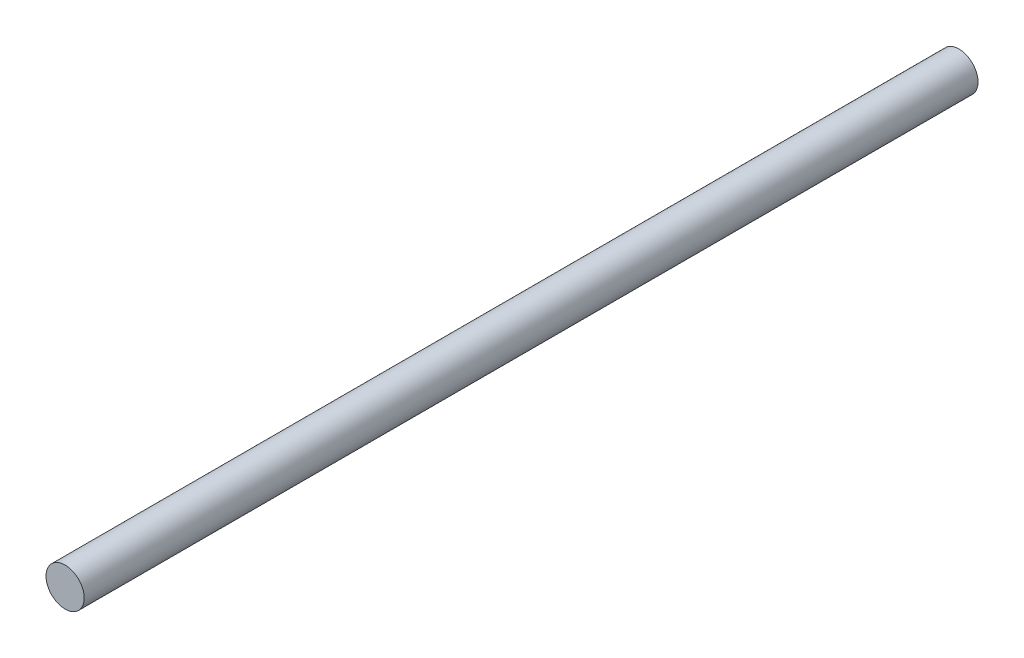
from build123d import *

# Parameters (mm, degrees)
SKETCH1_R      = 0.81407
EXTRUDE1_DEPTH = 38.1


with BuildPart() as part:
    # Sketch1 → Extrude1 (new body)
    with BuildSketch(Plane.XY):
        with Locations(Location((0, 0, 0), (0, 0, 180))):
            Circle(SKETCH1_R)
    extrude(amount=EXTRUDE1_DEPTH)


solid = part.part
